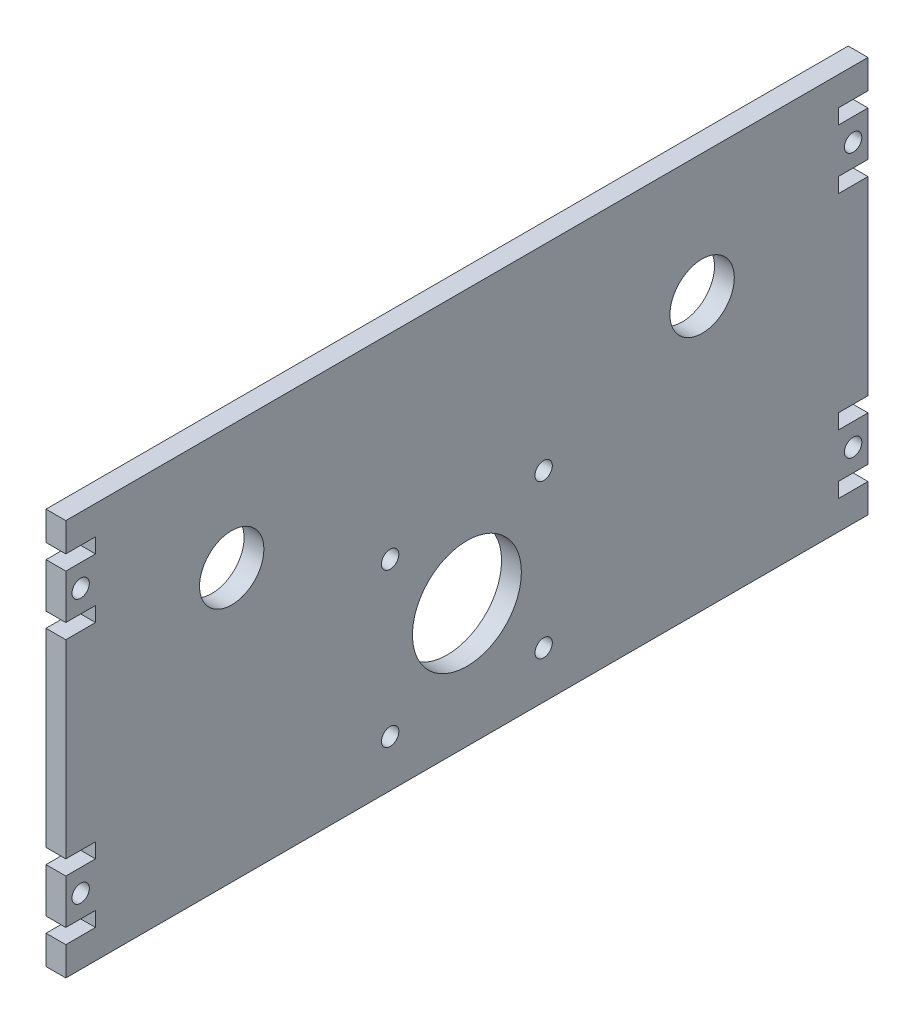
ISO-10303-21;
HEADER;
FILE_DESCRIPTION(('STEP AP214'),'2;1');
FILE_NAME('part.step','',(''),(''),'','','');
FILE_SCHEMA(('AUTOMOTIVE_DESIGN { 1 0 10303 214 1 1 1 1 }'));
ENDSEC;
DATA;
#1=APPLICATION_CONTEXT('core data for automotive mechanical design processes');
#2=APPLICATION_PROTOCOL_DEFINITION('international standard','automotive_design',2000,#1);
#3=PRODUCT_CONTEXT('',#1,'mechanical');
#4=PRODUCT('Part','Part','',(#3));
#5=PRODUCT_RELATED_PRODUCT_CATEGORY('part','',(#4));
#6=PRODUCT_DEFINITION_FORMATION('','',#4);
#7=PRODUCT_DEFINITION_CONTEXT('part definition',#1,'design');
#8=PRODUCT_DEFINITION('design','',#6,#7);
#9=PRODUCT_DEFINITION_SHAPE('','',#8);
#10=(LENGTH_UNIT() NAMED_UNIT(*) SI_UNIT(.MILLI.,.METRE.));
#11=(NAMED_UNIT(*) PLANE_ANGLE_UNIT() SI_UNIT($,.RADIAN.));
#12=(NAMED_UNIT(*) SI_UNIT($,.STERADIAN.) SOLID_ANGLE_UNIT());
#13=UNCERTAINTY_MEASURE_WITH_UNIT(LENGTH_MEASURE(1.E-05),#10,'distance_accuracy_value','');
#14=(GEOMETRIC_REPRESENTATION_CONTEXT(3) GLOBAL_UNCERTAINTY_ASSIGNED_CONTEXT((#13)) GLOBAL_UNIT_ASSIGNED_CONTEXT((#10,
#11,#12)) REPRESENTATION_CONTEXT('',''));
#15=CARTESIAN_POINT('',(0.,0.,0.));
#16=DIRECTION('',(0.,0.,1.));
#17=DIRECTION('',(1.,0.,0.));
#18=AXIS2_PLACEMENT_3D('',#15,#16,#17);
#19=CARTESIAN_POINT('',(2.,-40.,81.));
#20=DIRECTION('',(0.,0.,-1.));
#21=DIRECTION('',(-1.,0.,0.));
#22=AXIS2_PLACEMENT_3D('',#19,#20,#21);
#23=PLANE('',#22);
#24=DIRECTION('',(0.,-1.,0.));
#25=VECTOR('',#24,1.);
#26=CARTESIAN_POINT('',(-2.,-40.,81.));
#27=LINE('',#26,#25);
#28=CARTESIAN_POINT('',(-2.,-22.1666666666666,81.));
#29=VERTEX_POINT('',#28);
#30=CARTESIAN_POINT('',(-2.,-31.1666666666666,81.));
#31=VERTEX_POINT('',#30);
#32=EDGE_CURVE('E536',#29,#31,#27,.T.);
#33=ORIENTED_EDGE('',*,*,#32,.T.);
#34=DIRECTION('',(1.,0.,0.));
#35=VECTOR('',#34,1.);
#36=CARTESIAN_POINT('',(-2.,-31.1666666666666,81.));
#37=LINE('',#36,#35);
#38=CARTESIAN_POINT('',(2.,-31.1666666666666,81.));
#39=VERTEX_POINT('',#38);
#40=EDGE_CURVE('E451',#31,#39,#37,.T.);
#41=ORIENTED_EDGE('',*,*,#40,.T.);
#42=DIRECTION('',(0.,-1.,0.));
#43=VECTOR('',#42,1.);
#44=CARTESIAN_POINT('',(2.,-40.,81.));
#45=LINE('',#44,#43);
#46=CARTESIAN_POINT('',(2.,-22.1666666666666,81.));
#47=VERTEX_POINT('',#46);
#48=EDGE_CURVE('E565',#47,#39,#45,.T.);
#49=ORIENTED_EDGE('',*,*,#48,.F.);
#50=DIRECTION('',(1.,0.,0.));
#51=VECTOR('',#50,1.);
#52=CARTESIAN_POINT('',(-2.,-22.1666666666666,81.));
#53=LINE('',#52,#51);
#54=EDGE_CURVE('E442',#29,#47,#53,.T.);
#55=ORIENTED_EDGE('',*,*,#54,.F.);
#56=EDGE_LOOP('',(#33,#41,#49,#55));
#57=FACE_BOUND('',#56,.T.);
#58=ADVANCED_FACE('F34',(#57),#23,.F.);
#59=CARTESIAN_POINT('',(-2.,19.1666666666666,81.));
#60=VERTEX_POINT('',#59);
#61=CARTESIAN_POINT('',(-2.,-19.1666666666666,81.));
#62=VERTEX_POINT('',#61);
#63=EDGE_CURVE('E535',#60,#62,#27,.T.);
#64=ORIENTED_EDGE('',*,*,#63,.T.);
#65=DIRECTION('',(1.,0.,0.));
#66=VECTOR('',#65,1.);
#67=CARTESIAN_POINT('',(-2.,-19.1666666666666,81.));
#68=LINE('',#67,#66);
#69=CARTESIAN_POINT('',(2.,-19.1666666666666,81.));
#70=VERTEX_POINT('',#69);
#71=EDGE_CURVE('E430',#62,#70,#68,.T.);
#72=ORIENTED_EDGE('',*,*,#71,.T.);
#73=CARTESIAN_POINT('',(2.,19.1666666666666,81.));
#74=VERTEX_POINT('',#73);
#75=EDGE_CURVE('E563',#74,#70,#45,.T.);
#76=ORIENTED_EDGE('',*,*,#75,.F.);
#77=DIRECTION('',(1.,0.,0.));
#78=VECTOR('',#77,1.);
#79=CARTESIAN_POINT('',(-2.,19.1666666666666,81.));
#80=LINE('',#79,#78);
#81=EDGE_CURVE('E404',#60,#74,#80,.T.);
#82=ORIENTED_EDGE('',*,*,#81,.F.);
#83=EDGE_LOOP('',(#64,#72,#76,#82));
#84=FACE_BOUND('',#83,.T.);
#85=ADVANCED_FACE('F549',(#84),#23,.F.);
#86=CARTESIAN_POINT('',(-2.,31.1666666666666,81.));
#87=VERTEX_POINT('',#86);
#88=CARTESIAN_POINT('',(-2.,22.1666666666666,81.));
#89=VERTEX_POINT('',#88);
#90=EDGE_CURVE('E531',#87,#89,#27,.T.);
#91=ORIENTED_EDGE('',*,*,#90,.T.);
#92=DIRECTION('',(1.,0.,0.));
#93=VECTOR('',#92,1.);
#94=CARTESIAN_POINT('',(-2.,22.1666666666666,81.));
#95=LINE('',#94,#93);
#96=CARTESIAN_POINT('',(2.,22.1666666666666,81.));
#97=VERTEX_POINT('',#96);
#98=EDGE_CURVE('E393',#89,#97,#95,.T.);
#99=ORIENTED_EDGE('',*,*,#98,.T.);
#100=CARTESIAN_POINT('',(2.,31.1666666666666,81.));
#101=VERTEX_POINT('',#100);
#102=EDGE_CURVE('E524',#101,#97,#45,.T.);
#103=ORIENTED_EDGE('',*,*,#102,.F.);
#104=DIRECTION('',(1.,0.,0.));
#105=VECTOR('',#104,1.);
#106=CARTESIAN_POINT('',(-2.,31.1666666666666,81.));
#107=LINE('',#106,#105);
#108=EDGE_CURVE('E462',#87,#101,#107,.T.);
#109=ORIENTED_EDGE('',*,*,#108,.F.);
#110=EDGE_LOOP('',(#91,#99,#103,#109));
#111=FACE_BOUND('',#110,.T.);
#112=ADVANCED_FACE('F588',(#111),#23,.F.);
#113=CARTESIAN_POINT('',(-2.,40.,81.));
#114=VERTEX_POINT('',#113);
#115=CARTESIAN_POINT('',(-2.,34.1666666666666,81.));
#116=VERTEX_POINT('',#115);
#117=EDGE_CURVE('E529',#114,#116,#27,.T.);
#118=ORIENTED_EDGE('',*,*,#117,.T.);
#119=DIRECTION('',(1.,0.,0.));
#120=VECTOR('',#119,1.);
#121=CARTESIAN_POINT('',(-2.,34.1666666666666,81.));
#122=LINE('',#121,#120);
#123=CARTESIAN_POINT('',(2.,34.1666666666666,81.));
#124=VERTEX_POINT('',#123);
#125=EDGE_CURVE('E469',#116,#124,#122,.T.);
#126=ORIENTED_EDGE('',*,*,#125,.T.);
#127=CARTESIAN_POINT('',(2.,40.,81.));
#128=VERTEX_POINT('',#127);
#129=EDGE_CURVE('E520',#128,#124,#45,.T.);
#130=ORIENTED_EDGE('',*,*,#129,.F.);
#131=DIRECTION('',(-1.,0.,0.));
#132=VECTOR('',#131,1.);
#133=CARTESIAN_POINT('',(2.,40.,81.));
#134=LINE('',#133,#132);
#135=EDGE_CURVE('E308',#128,#114,#134,.T.);
#136=ORIENTED_EDGE('',*,*,#135,.T.);
#137=EDGE_LOOP('',(#118,#126,#130,#136));
#138=FACE_BOUND('',#137,.T.);
#139=ADVANCED_FACE('F577',(#138),#23,.F.);
#140=CARTESIAN_POINT('',(2.,-40.,-81.));
#141=DIRECTION('',(0.,0.,1.));
#142=DIRECTION('',(1.,0.,0.));
#143=AXIS2_PLACEMENT_3D('',#140,#141,#142);
#144=PLANE('',#143);
#145=DIRECTION('',(0.,1.,0.));
#146=VECTOR('',#145,1.);
#147=CARTESIAN_POINT('',(-2.,-40.,-81.));
#148=LINE('',#147,#146);
#149=CARTESIAN_POINT('',(-2.,-31.1666666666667,-81.));
#150=VERTEX_POINT('',#149);
#151=CARTESIAN_POINT('',(-2.,-22.1666666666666,-81.));
#152=VERTEX_POINT('',#151);
#153=EDGE_CURVE('E293',#150,#152,#148,.T.);
#154=ORIENTED_EDGE('',*,*,#153,.T.);
#155=DIRECTION('',(1.,0.,0.));
#156=VECTOR('',#155,1.);
#157=CARTESIAN_POINT('',(-2.,-22.1666666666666,-81.));
#158=LINE('',#157,#156);
#159=CARTESIAN_POINT('',(2.,-22.1666666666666,-81.));
#160=VERTEX_POINT('',#159);
#161=EDGE_CURVE('E363',#152,#160,#158,.T.);
#162=ORIENTED_EDGE('',*,*,#161,.T.);
#163=DIRECTION('',(0.,1.,0.));
#164=VECTOR('',#163,1.);
#165=CARTESIAN_POINT('',(2.,-40.,-81.));
#166=LINE('',#165,#164);
#167=CARTESIAN_POINT('',(2.,-31.1666666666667,-81.));
#168=VERTEX_POINT('',#167);
#169=EDGE_CURVE('E528',#168,#160,#166,.T.);
#170=ORIENTED_EDGE('',*,*,#169,.F.);
#171=DIRECTION('',(1.,0.,0.));
#172=VECTOR('',#171,1.);
#173=CARTESIAN_POINT('',(-2.,-31.1666666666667,-81.));
#174=LINE('',#173,#172);
#175=EDGE_CURVE('E355',#150,#168,#174,.T.);
#176=ORIENTED_EDGE('',*,*,#175,.F.);
#177=EDGE_LOOP('',(#154,#162,#170,#176));
#178=FACE_BOUND('',#177,.T.);
#179=ADVANCED_FACE('F587',(#178),#144,.F.);
#180=CARTESIAN_POINT('',(-2.,-40.,-81.));
#181=VERTEX_POINT('',#180);
#182=CARTESIAN_POINT('',(-2.,-34.1666666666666,-81.));
#183=VERTEX_POINT('',#182);
#184=EDGE_CURVE('E297',#181,#183,#148,.T.);
#185=ORIENTED_EDGE('',*,*,#184,.T.);
#186=DIRECTION('',(1.,0.,0.));
#187=VECTOR('',#186,1.);
#188=CARTESIAN_POINT('',(-2.,-34.1666666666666,-81.));
#189=LINE('',#188,#187);
#190=CARTESIAN_POINT('',(2.,-34.1666666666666,-81.));
#191=VERTEX_POINT('',#190);
#192=EDGE_CURVE('E344',#183,#191,#189,.T.);
#193=ORIENTED_EDGE('',*,*,#192,.T.);
#194=CARTESIAN_POINT('',(2.,-40.,-81.));
#195=VERTEX_POINT('',#194);
#196=EDGE_CURVE('E322',#195,#191,#166,.T.);
#197=ORIENTED_EDGE('',*,*,#196,.F.);
#198=DIRECTION('',(-1.,0.,0.));
#199=VECTOR('',#198,1.);
#200=CARTESIAN_POINT('',(2.,-40.,-81.));
#201=LINE('',#200,#199);
#202=EDGE_CURVE('E42',#195,#181,#201,.T.);
#203=ORIENTED_EDGE('',*,*,#202,.T.);
#204=EDGE_LOOP('',(#185,#193,#197,#203));
#205=FACE_BOUND('',#204,.T.);
#206=ADVANCED_FACE('F319',(#205),#144,.F.);
#207=CARTESIAN_POINT('',(2.,-19.1666666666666,-81.));
#208=VERTEX_POINT('',#207);
#209=CARTESIAN_POINT('',(2.,19.1666666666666,-81.));
#210=VERTEX_POINT('',#209);
#211=EDGE_CURVE('E994',#208,#210,#166,.T.);
#212=ORIENTED_EDGE('',*,*,#211,.F.);
#213=DIRECTION('',(1.,0.,0.));
#214=VECTOR('',#213,1.);
#215=CARTESIAN_POINT('',(-2.,-19.1666666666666,-81.));
#216=LINE('',#215,#214);
#217=CARTESIAN_POINT('',(-2.,-19.1666666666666,-81.));
#218=VERTEX_POINT('',#217);
#219=EDGE_CURVE('E292',#218,#208,#216,.T.);
#220=ORIENTED_EDGE('',*,*,#219,.F.);
#221=CARTESIAN_POINT('',(-2.,19.1666666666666,-81.));
#222=VERTEX_POINT('',#221);
#223=EDGE_CURVE('E285',#218,#222,#148,.T.);
#224=ORIENTED_EDGE('',*,*,#223,.T.);
#225=DIRECTION('',(1.,0.,0.));
#226=VECTOR('',#225,1.);
#227=CARTESIAN_POINT('',(-2.,19.1666666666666,-81.));
#228=LINE('',#227,#226);
#229=EDGE_CURVE('E267',#222,#210,#228,.T.);
#230=ORIENTED_EDGE('',*,*,#229,.T.);
#231=EDGE_LOOP('',(#212,#220,#224,#230));
#232=FACE_BOUND('',#231,.T.);
#233=ADVANCED_FACE('F291',(#232),#144,.F.);
#234=CARTESIAN_POINT('',(2.,22.1666666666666,-81.));
#235=VERTEX_POINT('',#234);
#236=CARTESIAN_POINT('',(2.,31.1666666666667,-81.));
#237=VERTEX_POINT('',#236);
#238=EDGE_CURVE('E995',#235,#237,#166,.T.);
#239=ORIENTED_EDGE('',*,*,#238,.F.);
#240=DIRECTION('',(1.,0.,0.));
#241=VECTOR('',#240,1.);
#242=CARTESIAN_POINT('',(-2.,22.1666666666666,-81.));
#243=LINE('',#242,#241);
#244=CARTESIAN_POINT('',(-2.,22.1666666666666,-81.));
#245=VERTEX_POINT('',#244);
#246=EDGE_CURVE('E278',#245,#235,#243,.T.);
#247=ORIENTED_EDGE('',*,*,#246,.F.);
#248=CARTESIAN_POINT('',(-2.,31.1666666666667,-81.));
#249=VERTEX_POINT('',#248);
#250=EDGE_CURVE('E294',#245,#249,#148,.T.);
#251=ORIENTED_EDGE('',*,*,#250,.T.);
#252=DIRECTION('',(1.,0.,0.));
#253=VECTOR('',#252,1.);
#254=CARTESIAN_POINT('',(-2.,31.1666666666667,-81.));
#255=LINE('',#254,#253);
#256=EDGE_CURVE('E1008',#249,#237,#255,.T.);
#257=ORIENTED_EDGE('',*,*,#256,.T.);
#258=EDGE_LOOP('',(#239,#247,#251,#257));
#259=FACE_BOUND('',#258,.T.);
#260=ADVANCED_FACE('F576',(#259),#144,.F.);
#261=CARTESIAN_POINT('',(2.,-34.1666666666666,81.));
#262=VERTEX_POINT('',#261);
#263=CARTESIAN_POINT('',(2.,-40.,81.));
#264=VERTEX_POINT('',#263);
#265=EDGE_CURVE('E307',#262,#264,#45,.T.);
#266=ORIENTED_EDGE('',*,*,#265,.F.);
#267=DIRECTION('',(1.,0.,0.));
#268=VECTOR('',#267,1.);
#269=CARTESIAN_POINT('',(-2.,-34.1666666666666,81.));
#270=LINE('',#269,#268);
#271=CARTESIAN_POINT('',(-2.,-34.1666666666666,81.));
#272=VERTEX_POINT('',#271);
#273=EDGE_CURVE('E340',#272,#262,#270,.T.);
#274=ORIENTED_EDGE('',*,*,#273,.F.);
#275=CARTESIAN_POINT('',(-2.,-40.,81.));
#276=VERTEX_POINT('',#275);
#277=EDGE_CURVE('E481',#272,#276,#27,.T.);
#278=ORIENTED_EDGE('',*,*,#277,.T.);
#279=DIRECTION('',(-1.,0.,0.));
#280=VECTOR('',#279,1.);
#281=CARTESIAN_POINT('',(2.,-40.,81.));
#282=LINE('',#281,#280);
#283=EDGE_CURVE('E11',#264,#276,#282,.T.);
#284=ORIENTED_EDGE('',*,*,#283,.F.);
#285=EDGE_LOOP('',(#266,#274,#278,#284));
#286=FACE_BOUND('',#285,.T.);
#287=ADVANCED_FACE('F36',(#286),#23,.F.);
#288=CARTESIAN_POINT('',(2.,-40.,-81.));
#289=DIRECTION('',(0.,1.,0.));
#290=DIRECTION('',(0.,0.,1.));
#291=AXIS2_PLACEMENT_3D('',#288,#289,#290);
#292=PLANE('',#291);
#293=DIRECTION('',(0.,0.,-1.));
#294=VECTOR('',#293,1.);
#295=CARTESIAN_POINT('',(-2.,-40.,-81.));
#296=LINE('',#295,#294);
#297=EDGE_CURVE('E304',#276,#181,#296,.T.);
#298=ORIENTED_EDGE('',*,*,#297,.T.);
#299=ORIENTED_EDGE('',*,*,#202,.F.);
#300=DIRECTION('',(0.,0.,-1.));
#301=VECTOR('',#300,1.);
#302=CARTESIAN_POINT('',(2.,-40.,-81.));
#303=LINE('',#302,#301);
#304=EDGE_CURVE('E523',#264,#195,#303,.T.);
#305=ORIENTED_EDGE('',*,*,#304,.F.);
#306=ORIENTED_EDGE('',*,*,#283,.T.);
#307=EDGE_LOOP('',(#298,#299,#305,#306));
#308=FACE_BOUND('',#307,.T.);
#309=ADVANCED_FACE('F574',(#308),#292,.F.);
#310=CARTESIAN_POINT('',(2.,34.1666666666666,-81.));
#311=VERTEX_POINT('',#310);
#312=CARTESIAN_POINT('',(2.,40.,-81.));
#313=VERTEX_POINT('',#312);
#314=EDGE_CURVE('E526',#311,#313,#166,.T.);
#315=ORIENTED_EDGE('',*,*,#314,.F.);
#316=DIRECTION('',(1.,0.,0.));
#317=VECTOR('',#316,1.);
#318=CARTESIAN_POINT('',(-2.,34.1666666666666,-81.));
#319=LINE('',#318,#317);
#320=CARTESIAN_POINT('',(-2.,34.1666666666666,-81.));
#321=VERTEX_POINT('',#320);
#322=EDGE_CURVE('E631',#321,#311,#319,.T.);
#323=ORIENTED_EDGE('',*,*,#322,.F.);
#324=CARTESIAN_POINT('',(-2.,40.,-81.));
#325=VERTEX_POINT('',#324);
#326=EDGE_CURVE('E299',#321,#325,#148,.T.);
#327=ORIENTED_EDGE('',*,*,#326,.T.);
#328=DIRECTION('',(-1.,0.,0.));
#329=VECTOR('',#328,1.);
#330=CARTESIAN_POINT('',(2.,40.,-81.));
#331=LINE('',#330,#329);
#332=EDGE_CURVE('E311',#313,#325,#331,.T.);
#333=ORIENTED_EDGE('',*,*,#332,.F.);
#334=EDGE_LOOP('',(#315,#323,#327,#333));
#335=FACE_BOUND('',#334,.T.);
#336=ADVANCED_FACE('F582',(#335),#144,.F.);
#337=CARTESIAN_POINT('',(2.,40.,-81.));
#338=DIRECTION('',(0.,-1.,0.));
#339=DIRECTION('',(0.,0.,-1.));
#340=AXIS2_PLACEMENT_3D('',#337,#338,#339);
#341=PLANE('',#340);
#342=DIRECTION('',(0.,0.,1.));
#343=VECTOR('',#342,1.);
#344=CARTESIAN_POINT('',(-2.,40.,-81.));
#345=LINE('',#344,#343);
#346=EDGE_CURVE('E303',#325,#114,#345,.T.);
#347=ORIENTED_EDGE('',*,*,#346,.T.);
#348=ORIENTED_EDGE('',*,*,#135,.F.);
#349=DIRECTION('',(0.,0.,1.));
#350=VECTOR('',#349,1.);
#351=CARTESIAN_POINT('',(2.,40.,-81.));
#352=LINE('',#351,#350);
#353=EDGE_CURVE('E312',#313,#128,#352,.T.);
#354=ORIENTED_EDGE('',*,*,#353,.F.);
#355=ORIENTED_EDGE('',*,*,#332,.T.);
#356=EDGE_LOOP('',(#347,#348,#354,#355));
#357=FACE_BOUND('',#356,.T.);
#358=ADVANCED_FACE('F624',(#357),#341,.F.);
#359=CARTESIAN_POINT('',(2.,0.,0.));
#360=DIRECTION('',(1.,0.,0.));
#361=DIRECTION('',(0.,0.,-1.));
#362=AXIS2_PLACEMENT_3D('',#359,#360,#361);
#363=PLANE('',#362);
#364=DIRECTION('',(0.,0.,-1.));
#365=VECTOR('',#364,1.);
#366=CARTESIAN_POINT('',(2.,-22.1666666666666,-81.));
#367=LINE('',#366,#365);
#368=CARTESIAN_POINT('',(2.,-22.1666666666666,-75.));
#369=VERTEX_POINT('',#368);
#370=EDGE_CURVE('E366',#369,#160,#367,.T.);
#371=ORIENTED_EDGE('',*,*,#370,.F.);
#372=DIRECTION('',(0.,-1.,0.));
#373=VECTOR('',#372,1.);
#374=CARTESIAN_POINT('',(2.,-19.1666666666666,-75.));
#375=LINE('',#374,#373);
#376=CARTESIAN_POINT('',(2.,-19.1666666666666,-75.));
#377=VERTEX_POINT('',#376);
#378=EDGE_CURVE('E374',#377,#369,#375,.T.);
#379=ORIENTED_EDGE('',*,*,#378,.F.);
#380=DIRECTION('',(0.,0.,1.));
#381=VECTOR('',#380,1.);
#382=CARTESIAN_POINT('',(2.,-19.1666666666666,-81.));
#383=LINE('',#382,#381);
#384=EDGE_CURVE('E371',#208,#377,#383,.T.);
#385=ORIENTED_EDGE('',*,*,#384,.F.);
#386=ORIENTED_EDGE('',*,*,#211,.T.);
#387=DIRECTION('',(0.,0.,-1.));
#388=VECTOR('',#387,1.);
#389=CARTESIAN_POINT('',(2.,19.1666666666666,-81.));
#390=LINE('',#389,#388);
#391=CARTESIAN_POINT('',(2.,19.1666666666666,-75.));
#392=VERTEX_POINT('',#391);
#393=EDGE_CURVE('E273',#392,#210,#390,.T.);
#394=ORIENTED_EDGE('',*,*,#393,.F.);
#395=DIRECTION('',(0.,-1.,0.));
#396=VECTOR('',#395,1.);
#397=CARTESIAN_POINT('',(2.,19.1666666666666,-75.));
#398=LINE('',#397,#396);
#399=CARTESIAN_POINT('',(2.,22.1666666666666,-75.));
#400=VERTEX_POINT('',#399);
#401=EDGE_CURVE('E288',#400,#392,#398,.T.);
#402=ORIENTED_EDGE('',*,*,#401,.F.);
#403=DIRECTION('',(0.,0.,1.));
#404=VECTOR('',#403,1.);
#405=CARTESIAN_POINT('',(2.,22.1666666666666,-81.));
#406=LINE('',#405,#404);
#407=EDGE_CURVE('E1004',#235,#400,#406,.T.);
#408=ORIENTED_EDGE('',*,*,#407,.F.);
#409=ORIENTED_EDGE('',*,*,#238,.T.);
#410=DIRECTION('',(0.,0.,-1.));
#411=VECTOR('',#410,1.);
#412=CARTESIAN_POINT('',(2.,31.1666666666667,-81.));
#413=LINE('',#412,#411);
#414=CARTESIAN_POINT('',(2.,31.1666666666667,-75.));
#415=VERTEX_POINT('',#414);
#416=EDGE_CURVE('E1001',#415,#237,#413,.T.);
#417=ORIENTED_EDGE('',*,*,#416,.F.);
#418=DIRECTION('',(0.,-1.,0.));
#419=VECTOR('',#418,1.);
#420=CARTESIAN_POINT('',(2.,34.1666666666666,-75.));
#421=LINE('',#420,#419);
#422=CARTESIAN_POINT('',(2.,34.1666666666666,-75.));
#423=VERTEX_POINT('',#422);
#424=EDGE_CURVE('E1017',#423,#415,#421,.T.);
#425=ORIENTED_EDGE('',*,*,#424,.F.);
#426=DIRECTION('',(0.,0.,1.));
#427=VECTOR('',#426,1.);
#428=CARTESIAN_POINT('',(2.,34.1666666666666,-81.));
#429=LINE('',#428,#427);
#430=EDGE_CURVE('E1020',#311,#423,#429,.T.);
#431=ORIENTED_EDGE('',*,*,#430,.F.);
#432=ORIENTED_EDGE('',*,*,#314,.T.);
#433=ORIENTED_EDGE('',*,*,#353,.T.);
#434=ORIENTED_EDGE('',*,*,#129,.T.);
#435=DIRECTION('',(0.,0.,1.));
#436=VECTOR('',#435,1.);
#437=CARTESIAN_POINT('',(2.,34.1666666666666,81.));
#438=LINE('',#437,#436);
#439=CARTESIAN_POINT('',(2.,34.1666666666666,75.));
#440=VERTEX_POINT('',#439);
#441=EDGE_CURVE('E456',#440,#124,#438,.T.);
#442=ORIENTED_EDGE('',*,*,#441,.F.);
#443=DIRECTION('',(0.,1.,0.));
#444=VECTOR('',#443,1.);
#445=CARTESIAN_POINT('',(2.,34.1666666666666,75.));
#446=LINE('',#445,#444);
#447=CARTESIAN_POINT('',(2.,31.1666666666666,75.));
#448=VERTEX_POINT('',#447);
#449=EDGE_CURVE('E465',#448,#440,#446,.T.);
#450=ORIENTED_EDGE('',*,*,#449,.F.);
#451=DIRECTION('',(0.,0.,-1.));
#452=VECTOR('',#451,1.);
#453=CARTESIAN_POINT('',(2.,31.1666666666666,81.));
#454=LINE('',#453,#452);
#455=EDGE_CURVE('E389',#101,#448,#454,.T.);
#456=ORIENTED_EDGE('',*,*,#455,.F.);
#457=ORIENTED_EDGE('',*,*,#102,.T.);
#458=DIRECTION('',(0.,0.,1.));
#459=VECTOR('',#458,1.);
#460=CARTESIAN_POINT('',(2.,22.1666666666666,81.));
#461=LINE('',#460,#459);
#462=CARTESIAN_POINT('',(2.,22.1666666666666,75.));
#463=VERTEX_POINT('',#462);
#464=EDGE_CURVE('E398',#463,#97,#461,.T.);
#465=ORIENTED_EDGE('',*,*,#464,.F.);
#466=DIRECTION('',(0.,1.,0.));
#467=VECTOR('',#466,1.);
#468=CARTESIAN_POINT('',(2.,19.1666666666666,75.));
#469=LINE('',#468,#467);
#470=CARTESIAN_POINT('',(2.,19.1666666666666,75.));
#471=VERTEX_POINT('',#470);
#472=EDGE_CURVE('E408',#471,#463,#469,.T.);
#473=ORIENTED_EDGE('',*,*,#472,.F.);
#474=DIRECTION('',(0.,0.,-1.));
#475=VECTOR('',#474,1.);
#476=CARTESIAN_POINT('',(2.,19.1666666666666,81.));
#477=LINE('',#476,#475);
#478=EDGE_CURVE('E405',#74,#471,#477,.T.);
#479=ORIENTED_EDGE('',*,*,#478,.F.);
#480=ORIENTED_EDGE('',*,*,#75,.T.);
#481=DIRECTION('',(0.,0.,1.));
#482=VECTOR('',#481,1.);
#483=CARTESIAN_POINT('',(2.,-19.1666666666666,81.));
#484=LINE('',#483,#482);
#485=CARTESIAN_POINT('',(2.,-19.1666666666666,75.));
#486=VERTEX_POINT('',#485);
#487=EDGE_CURVE('E431',#486,#70,#484,.T.);
#488=ORIENTED_EDGE('',*,*,#487,.F.);
#489=DIRECTION('',(0.,1.,0.));
#490=VECTOR('',#489,1.);
#491=CARTESIAN_POINT('',(2.,-19.1666666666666,75.));
#492=LINE('',#491,#490);
#493=CARTESIAN_POINT('',(2.,-22.1666666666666,75.));
#494=VERTEX_POINT('',#493);
#495=EDGE_CURVE('E424',#494,#486,#492,.T.);
#496=ORIENTED_EDGE('',*,*,#495,.F.);
#497=DIRECTION('',(0.,0.,-1.));
#498=VECTOR('',#497,1.);
#499=CARTESIAN_POINT('',(2.,-22.1666666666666,81.));
#500=LINE('',#499,#498);
#501=EDGE_CURVE('E433',#47,#494,#500,.T.);
#502=ORIENTED_EDGE('',*,*,#501,.F.);
#503=ORIENTED_EDGE('',*,*,#48,.T.);
#504=DIRECTION('',(0.,0.,1.));
#505=VECTOR('',#504,1.);
#506=CARTESIAN_POINT('',(2.,-31.1666666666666,81.));
#507=LINE('',#506,#505);
#508=CARTESIAN_POINT('',(2.,-31.1666666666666,75.));
#509=VERTEX_POINT('',#508);
#510=EDGE_CURVE('E648',#509,#39,#507,.T.);
#511=ORIENTED_EDGE('',*,*,#510,.F.);
#512=DIRECTION('',(0.,1.,0.));
#513=VECTOR('',#512,1.);
#514=CARTESIAN_POINT('',(2.,-34.1666666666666,75.));
#515=LINE('',#514,#513);
#516=CARTESIAN_POINT('',(2.,-34.1666666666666,75.));
#517=VERTEX_POINT('',#516);
#518=EDGE_CURVE('E655',#517,#509,#515,.T.);
#519=ORIENTED_EDGE('',*,*,#518,.F.);
#520=DIRECTION('',(0.,0.,-1.));
#521=VECTOR('',#520,1.);
#522=CARTESIAN_POINT('',(2.,-34.1666666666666,81.));
#523=LINE('',#522,#521);
#524=EDGE_CURVE('E352',#262,#517,#523,.T.);
#525=ORIENTED_EDGE('',*,*,#524,.F.);
#526=ORIENTED_EDGE('',*,*,#265,.T.);
#527=ORIENTED_EDGE('',*,*,#304,.T.);
#528=ORIENTED_EDGE('',*,*,#196,.T.);
#529=DIRECTION('',(0.,0.,-1.));
#530=VECTOR('',#529,1.);
#531=CARTESIAN_POINT('',(2.,-34.1666666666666,-81.));
#532=LINE('',#531,#530);
#533=CARTESIAN_POINT('',(2.,-34.1666666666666,-75.));
#534=VERTEX_POINT('',#533);
#535=EDGE_CURVE('E345',#534,#191,#532,.T.);
#536=ORIENTED_EDGE('',*,*,#535,.F.);
#537=DIRECTION('',(0.,-1.,0.));
#538=VECTOR('',#537,1.);
#539=CARTESIAN_POINT('',(2.,-34.1666666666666,-75.));
#540=LINE('',#539,#538);
#541=CARTESIAN_POINT('',(2.,-31.1666666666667,-75.));
#542=VERTEX_POINT('',#541);
#543=EDGE_CURVE('E333',#542,#534,#540,.T.);
#544=ORIENTED_EDGE('',*,*,#543,.F.);
#545=DIRECTION('',(0.,0.,1.));
#546=VECTOR('',#545,1.);
#547=CARTESIAN_POINT('',(2.,-31.1666666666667,-81.));
#548=LINE('',#547,#546);
#549=EDGE_CURVE('E337',#168,#542,#548,.T.);
#550=ORIENTED_EDGE('',*,*,#549,.F.);
#551=ORIENTED_EDGE('',*,*,#169,.T.);
#552=EDGE_LOOP('',(#371,#379,#385,#386,#394,#402,#408,#409,#417,#425,#431,#432,#433,#434,#442,
#450,#456,#457,#465,#473,#479,#480,#488,#496,#502,#503,#511,#519,#525,#526,#527,#528,#536,#544,
#550,#551));
#553=FACE_BOUND('',#552,.T.);
#554=CARTESIAN_POINT('',(2.,-26.6666666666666,-78.));
#555=DIRECTION('',(1.,0.,0.));
#556=DIRECTION('',(0.,0.,-1.));
#557=AXIS2_PLACEMENT_3D('',#554,#555,#556);
#558=CIRCLE('',#557,1.75);
#559=CARTESIAN_POINT('',(2.,-26.6666666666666,-79.75));
#560=VERTEX_POINT('',#559);
#561=EDGE_CURVE('E360',#560,#560,#558,.T.);
#562=ORIENTED_EDGE('',*,*,#561,.F.);
#563=EDGE_LOOP('',(#562));
#564=FACE_BOUND('',#563,.T.);
#565=CARTESIAN_POINT('',(2.,-26.6666666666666,78.));
#566=DIRECTION('',(1.,0.,0.));
#567=DIRECTION('',(0.,0.,1.));
#568=AXIS2_PLACEMENT_3D('',#565,#566,#567);
#569=CIRCLE('',#568,1.75);
#570=CARTESIAN_POINT('',(2.,-26.6666666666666,79.75));
#571=VERTEX_POINT('',#570);
#572=EDGE_CURVE('E448',#571,#571,#569,.T.);
#573=ORIENTED_EDGE('',*,*,#572,.F.);
#574=EDGE_LOOP('',(#573));
#575=FACE_BOUND('',#574,.T.);
#576=CARTESIAN_POINT('',(2.,26.6666666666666,78.));
#577=DIRECTION('',(1.,0.,0.));
#578=DIRECTION('',(0.,0.,-1.));
#579=AXIS2_PLACEMENT_3D('',#576,#577,#578);
#580=CIRCLE('',#579,1.75);
#581=CARTESIAN_POINT('',(2.,26.6666666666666,76.25));
#582=VERTEX_POINT('',#581);
#583=EDGE_CURVE('E390',#582,#582,#580,.T.);
#584=ORIENTED_EDGE('',*,*,#583,.F.);
#585=EDGE_LOOP('',(#584));
#586=FACE_BOUND('',#585,.T.);
#587=CARTESIAN_POINT('',(2.,26.6666666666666,-78.));
#588=DIRECTION('',(1.,0.,0.));
#589=DIRECTION('',(0.,0.,1.));
#590=AXIS2_PLACEMENT_3D('',#587,#588,#589);
#591=CIRCLE('',#590,1.75);
#592=CARTESIAN_POINT('',(2.,26.6666666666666,-76.25));
#593=VERTEX_POINT('',#592);
#594=EDGE_CURVE('E1010',#593,#593,#591,.T.);
#595=ORIENTED_EDGE('',*,*,#594,.F.);
#596=EDGE_LOOP('',(#595));
#597=FACE_BOUND('',#596,.T.);
#598=CARTESIAN_POINT('',(2.,15.,47.5));
#599=DIRECTION('',(1.,0.,0.));
#600=DIRECTION('',(0.,0.,-1.));
#601=AXIS2_PLACEMENT_3D('',#598,#599,#600);
#602=CIRCLE('',#601,6.5);
#603=CARTESIAN_POINT('',(2.,15.,41.));
#604=VERTEX_POINT('',#603);
#605=EDGE_CURVE('E482',#604,#604,#602,.T.);
#606=ORIENTED_EDGE('',*,*,#605,.F.);
#607=EDGE_LOOP('',(#606));
#608=FACE_BOUND('',#607,.T.);
#609=CARTESIAN_POINT('',(2.,0.499999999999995,-15.5));
#610=DIRECTION('',(1.,0.,0.));
#611=DIRECTION('',(0.,0.,-1.));
#612=AXIS2_PLACEMENT_3D('',#609,#610,#611);
#613=CIRCLE('',#612,1.75);
#614=CARTESIAN_POINT('',(2.,0.499999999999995,-17.25));
#615=VERTEX_POINT('',#614);
#616=EDGE_CURVE('E472',#615,#615,#613,.T.);
#617=ORIENTED_EDGE('',*,*,#616,.F.);
#618=EDGE_LOOP('',(#617));
#619=FACE_BOUND('',#618,.T.);
#620=CARTESIAN_POINT('',(2.,-30.5,-15.5));
#621=DIRECTION('',(1.,0.,0.));
#622=DIRECTION('',(0.,0.,-1.));
#623=AXIS2_PLACEMENT_3D('',#620,#621,#622);
#624=CIRCLE('',#623,1.75);
#625=CARTESIAN_POINT('',(2.,-30.5,-17.25));
#626=VERTEX_POINT('',#625);
#627=EDGE_CURVE('E490',#626,#626,#624,.T.);
#628=ORIENTED_EDGE('',*,*,#627,.F.);
#629=EDGE_LOOP('',(#628));
#630=FACE_BOUND('',#629,.T.);
#631=CARTESIAN_POINT('',(2.,-30.5,15.5));
#632=DIRECTION('',(1.,0.,0.));
#633=DIRECTION('',(0.,0.,-1.));
#634=AXIS2_PLACEMENT_3D('',#631,#632,#633);
#635=CIRCLE('',#634,1.75);
#636=CARTESIAN_POINT('',(2.,-30.5,13.75));
#637=VERTEX_POINT('',#636);
#638=EDGE_CURVE('E489',#637,#637,#635,.T.);
#639=ORIENTED_EDGE('',*,*,#638,.F.);
#640=EDGE_LOOP('',(#639));
#641=FACE_BOUND('',#640,.T.);
#642=CARTESIAN_POINT('',(2.,0.499999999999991,15.5));
#643=DIRECTION('',(1.,0.,0.));
#644=DIRECTION('',(0.,0.,-1.));
#645=AXIS2_PLACEMENT_3D('',#642,#643,#644);
#646=CIRCLE('',#645,1.75);
#647=CARTESIAN_POINT('',(2.,0.499999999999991,13.75));
#648=VERTEX_POINT('',#647);
#649=EDGE_CURVE('E512',#648,#648,#646,.T.);
#650=ORIENTED_EDGE('',*,*,#649,.F.);
#651=EDGE_LOOP('',(#650));
#652=FACE_BOUND('',#651,.T.);
#653=CARTESIAN_POINT('',(2.,-15.,0.));
#654=DIRECTION('',(1.,0.,0.));
#655=DIRECTION('',(0.,0.,-1.));
#656=AXIS2_PLACEMENT_3D('',#653,#654,#655);
#657=CIRCLE('',#656,11.);
#658=CARTESIAN_POINT('',(2.,-15.,-11.));
#659=VERTEX_POINT('',#658);
#660=EDGE_CURVE('E506',#659,#659,#657,.T.);
#661=ORIENTED_EDGE('',*,*,#660,.F.);
#662=EDGE_LOOP('',(#661));
#663=FACE_BOUND('',#662,.T.);
#664=CARTESIAN_POINT('',(2.,15.,-47.5));
#665=DIRECTION('',(1.,0.,0.));
#666=DIRECTION('',(0.,0.,-1.));
#667=AXIS2_PLACEMENT_3D('',#664,#665,#666);
#668=CIRCLE('',#667,6.49999999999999);
#669=CARTESIAN_POINT('',(2.,15.,-54.));
#670=VERTEX_POINT('',#669);
#671=EDGE_CURVE('E500',#670,#670,#668,.T.);
#672=ORIENTED_EDGE('',*,*,#671,.F.);
#673=EDGE_LOOP('',(#672));
#674=FACE_BOUND('',#673,.T.);
#675=ADVANCED_FACE('F559',(#553,#564,#575,#586,#597,#608,#619,#630,#641,#652,#663,#674),#363,.T.);
#676=CARTESIAN_POINT('',(-2.,0.,0.));
#677=DIRECTION('',(1.,0.,0.));
#678=DIRECTION('',(0.,0.,-1.));
#679=AXIS2_PLACEMENT_3D('',#676,#677,#678);
#680=PLANE('',#679);
#681=CARTESIAN_POINT('',(-2.,-26.6666666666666,-78.));
#682=DIRECTION('',(1.,0.,0.));
#683=DIRECTION('',(0.,0.,-1.));
#684=AXIS2_PLACEMENT_3D('',#681,#682,#683);
#685=CIRCLE('',#684,1.75);
#686=CARTESIAN_POINT('',(-2.,-26.6666666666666,-79.75));
#687=VERTEX_POINT('',#686);
#688=EDGE_CURVE('E347',#687,#687,#685,.T.);
#689=ORIENTED_EDGE('',*,*,#688,.T.);
#690=EDGE_LOOP('',(#689));
#691=FACE_BOUND('',#690,.T.);
#692=CARTESIAN_POINT('',(-2.,-26.6666666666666,78.));
#693=DIRECTION('',(1.,0.,0.));
#694=DIRECTION('',(0.,0.,1.));
#695=AXIS2_PLACEMENT_3D('',#692,#693,#694);
#696=CIRCLE('',#695,1.75);
#697=CARTESIAN_POINT('',(-2.,-26.6666666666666,79.75));
#698=VERTEX_POINT('',#697);
#699=EDGE_CURVE('E434',#698,#698,#696,.T.);
#700=ORIENTED_EDGE('',*,*,#699,.T.);
#701=EDGE_LOOP('',(#700));
#702=FACE_BOUND('',#701,.T.);
#703=CARTESIAN_POINT('',(-2.,26.6666666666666,78.));
#704=DIRECTION('',(1.,0.,0.));
#705=DIRECTION('',(0.,0.,-1.));
#706=AXIS2_PLACEMENT_3D('',#703,#704,#705);
#707=CIRCLE('',#706,1.75);
#708=CARTESIAN_POINT('',(-2.,26.6666666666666,76.25));
#709=VERTEX_POINT('',#708);
#710=EDGE_CURVE('E386',#709,#709,#707,.T.);
#711=ORIENTED_EDGE('',*,*,#710,.T.);
#712=EDGE_LOOP('',(#711));
#713=FACE_BOUND('',#712,.T.);
#714=CARTESIAN_POINT('',(-2.,26.6666666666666,-78.));
#715=DIRECTION('',(1.,0.,0.));
#716=DIRECTION('',(0.,0.,1.));
#717=AXIS2_PLACEMENT_3D('',#714,#715,#716);
#718=CIRCLE('',#717,1.75);
#719=CARTESIAN_POINT('',(-2.,26.6666666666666,-76.25));
#720=VERTEX_POINT('',#719);
#721=EDGE_CURVE('E1013',#720,#720,#718,.T.);
#722=ORIENTED_EDGE('',*,*,#721,.T.);
#723=EDGE_LOOP('',(#722));
#724=FACE_BOUND('',#723,.T.);
#725=CARTESIAN_POINT('',(-2.,15.,47.5));
#726=DIRECTION('',(1.,0.,0.));
#727=DIRECTION('',(0.,0.,-1.));
#728=AXIS2_PLACEMENT_3D('',#725,#726,#727);
#729=CIRCLE('',#728,6.5);
#730=CARTESIAN_POINT('',(-2.,15.,41.));
#731=VERTEX_POINT('',#730);
#732=EDGE_CURVE('E478',#731,#731,#729,.T.);
#733=ORIENTED_EDGE('',*,*,#732,.T.);
#734=EDGE_LOOP('',(#733));
#735=FACE_BOUND('',#734,.T.);
#736=CARTESIAN_POINT('',(-2.,0.499999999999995,-15.5));
#737=DIRECTION('',(1.,0.,0.));
#738=DIRECTION('',(0.,0.,-1.));
#739=AXIS2_PLACEMENT_3D('',#736,#737,#738);
#740=CIRCLE('',#739,1.75);
#741=CARTESIAN_POINT('',(-2.,0.499999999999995,-17.25));
#742=VERTEX_POINT('',#741);
#743=EDGE_CURVE('E493',#742,#742,#740,.T.);
#744=ORIENTED_EDGE('',*,*,#743,.T.);
#745=EDGE_LOOP('',(#744));
#746=FACE_BOUND('',#745,.T.);
#747=CARTESIAN_POINT('',(-2.,-30.5,-15.5));
#748=DIRECTION('',(1.,0.,0.));
#749=DIRECTION('',(0.,0.,-1.));
#750=AXIS2_PLACEMENT_3D('',#747,#748,#749);
#751=CIRCLE('',#750,1.75);
#752=CARTESIAN_POINT('',(-2.,-30.5,-17.25));
#753=VERTEX_POINT('',#752);
#754=EDGE_CURVE('E486',#753,#753,#751,.T.);
#755=ORIENTED_EDGE('',*,*,#754,.T.);
#756=EDGE_LOOP('',(#755));
#757=FACE_BOUND('',#756,.T.);
#758=CARTESIAN_POINT('',(-2.,-30.5,15.5));
#759=DIRECTION('',(1.,0.,0.));
#760=DIRECTION('',(0.,0.,-1.));
#761=AXIS2_PLACEMENT_3D('',#758,#759,#760);
#762=CIRCLE('',#761,1.75);
#763=CARTESIAN_POINT('',(-2.,-30.5,13.75));
#764=VERTEX_POINT('',#763);
#765=EDGE_CURVE('E515',#764,#764,#762,.T.);
#766=ORIENTED_EDGE('',*,*,#765,.T.);
#767=EDGE_LOOP('',(#766));
#768=FACE_BOUND('',#767,.T.);
#769=CARTESIAN_POINT('',(-2.,0.499999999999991,15.5));
#770=DIRECTION('',(1.,0.,0.));
#771=DIRECTION('',(0.,0.,-1.));
#772=AXIS2_PLACEMENT_3D('',#769,#770,#771);
#773=CIRCLE('',#772,1.75);
#774=CARTESIAN_POINT('',(-2.,0.499999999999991,13.75));
#775=VERTEX_POINT('',#774);
#776=EDGE_CURVE('E509',#775,#775,#773,.T.);
#777=ORIENTED_EDGE('',*,*,#776,.T.);
#778=EDGE_LOOP('',(#777));
#779=FACE_BOUND('',#778,.T.);
#780=CARTESIAN_POINT('',(-2.,-15.,0.));
#781=DIRECTION('',(1.,0.,0.));
#782=DIRECTION('',(0.,0.,-1.));
#783=AXIS2_PLACEMENT_3D('',#780,#781,#782);
#784=CIRCLE('',#783,11.);
#785=CARTESIAN_POINT('',(-2.,-15.,-11.));
#786=VERTEX_POINT('',#785);
#787=EDGE_CURVE('E503',#786,#786,#784,.T.);
#788=ORIENTED_EDGE('',*,*,#787,.T.);
#789=EDGE_LOOP('',(#788));
#790=FACE_BOUND('',#789,.T.);
#791=CARTESIAN_POINT('',(-2.,15.,-47.5));
#792=DIRECTION('',(1.,0.,0.));
#793=DIRECTION('',(0.,0.,-1.));
#794=AXIS2_PLACEMENT_3D('',#791,#792,#793);
#795=CIRCLE('',#794,6.49999999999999);
#796=CARTESIAN_POINT('',(-2.,15.,-54.));
#797=VERTEX_POINT('',#796);
#798=EDGE_CURVE('E485',#797,#797,#795,.T.);
#799=ORIENTED_EDGE('',*,*,#798,.T.);
#800=EDGE_LOOP('',(#799));
#801=FACE_BOUND('',#800,.T.);
#802=DIRECTION('',(0.,-1.,0.));
#803=VECTOR('',#802,1.);
#804=CARTESIAN_POINT('',(-2.,-19.1666666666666,-75.));
#805=LINE('',#804,#803);
#806=CARTESIAN_POINT('',(-2.,-19.1666666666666,-75.));
#807=VERTEX_POINT('',#806);
#808=CARTESIAN_POINT('',(-2.,-22.1666666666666,-75.));
#809=VERTEX_POINT('',#808);
#810=EDGE_CURVE('E49',#807,#809,#805,.T.);
#811=ORIENTED_EDGE('',*,*,#810,.T.);
#812=DIRECTION('',(0.,0.,-1.));
#813=VECTOR('',#812,1.);
#814=CARTESIAN_POINT('',(-2.,-22.1666666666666,-81.));
#815=LINE('',#814,#813);
#816=EDGE_CURVE('E368',#809,#152,#815,.T.);
#817=ORIENTED_EDGE('',*,*,#816,.T.);
#818=ORIENTED_EDGE('',*,*,#153,.F.);
#819=DIRECTION('',(0.,0.,1.));
#820=VECTOR('',#819,1.);
#821=CARTESIAN_POINT('',(-2.,-31.1666666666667,-81.));
#822=LINE('',#821,#820);
#823=CARTESIAN_POINT('',(-2.,-31.1666666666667,-75.));
#824=VERTEX_POINT('',#823);
#825=EDGE_CURVE('E332',#150,#824,#822,.T.);
#826=ORIENTED_EDGE('',*,*,#825,.T.);
#827=DIRECTION('',(0.,-1.,0.));
#828=VECTOR('',#827,1.);
#829=CARTESIAN_POINT('',(-2.,-34.1666666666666,-75.));
#830=LINE('',#829,#828);
#831=CARTESIAN_POINT('',(-2.,-34.1666666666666,-75.));
#832=VERTEX_POINT('',#831);
#833=EDGE_CURVE('E57',#824,#832,#830,.T.);
#834=ORIENTED_EDGE('',*,*,#833,.T.);
#835=DIRECTION('',(0.,0.,-1.));
#836=VECTOR('',#835,1.);
#837=CARTESIAN_POINT('',(-2.,-34.1666666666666,-81.));
#838=LINE('',#837,#836);
#839=EDGE_CURVE('E329',#832,#183,#838,.T.);
#840=ORIENTED_EDGE('',*,*,#839,.T.);
#841=ORIENTED_EDGE('',*,*,#184,.F.);
#842=ORIENTED_EDGE('',*,*,#297,.F.);
#843=ORIENTED_EDGE('',*,*,#277,.F.);
#844=DIRECTION('',(0.,0.,-1.));
#845=VECTOR('',#844,1.);
#846=CARTESIAN_POINT('',(-2.,-34.1666666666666,81.));
#847=LINE('',#846,#845);
#848=CARTESIAN_POINT('',(-2.,-34.1666666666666,75.));
#849=VERTEX_POINT('',#848);
#850=EDGE_CURVE('E644',#272,#849,#847,.T.);
#851=ORIENTED_EDGE('',*,*,#850,.T.);
#852=DIRECTION('',(0.,1.,0.));
#853=VECTOR('',#852,1.);
#854=CARTESIAN_POINT('',(-2.,-34.1666666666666,75.));
#855=LINE('',#854,#853);
#856=CARTESIAN_POINT('',(-2.,-31.1666666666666,75.));
#857=VERTEX_POINT('',#856);
#858=EDGE_CURVE('E647',#849,#857,#855,.T.);
#859=ORIENTED_EDGE('',*,*,#858,.T.);
#860=DIRECTION('',(0.,0.,1.));
#861=VECTOR('',#860,1.);
#862=CARTESIAN_POINT('',(-2.,-31.1666666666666,81.));
#863=LINE('',#862,#861);
#864=EDGE_CURVE('E651',#857,#31,#863,.T.);
#865=ORIENTED_EDGE('',*,*,#864,.T.);
#866=ORIENTED_EDGE('',*,*,#32,.F.);
#867=DIRECTION('',(0.,0.,-1.));
#868=VECTOR('',#867,1.);
#869=CARTESIAN_POINT('',(-2.,-22.1666666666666,81.));
#870=LINE('',#869,#868);
#871=CARTESIAN_POINT('',(-2.,-22.1666666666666,75.));
#872=VERTEX_POINT('',#871);
#873=EDGE_CURVE('E423',#29,#872,#870,.T.);
#874=ORIENTED_EDGE('',*,*,#873,.T.);
#875=DIRECTION('',(0.,1.,0.));
#876=VECTOR('',#875,1.);
#877=CARTESIAN_POINT('',(-2.,-19.1666666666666,75.));
#878=LINE('',#877,#876);
#879=CARTESIAN_POINT('',(-2.,-19.1666666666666,75.));
#880=VERTEX_POINT('',#879);
#881=EDGE_CURVE('E427',#872,#880,#878,.T.);
#882=ORIENTED_EDGE('',*,*,#881,.T.);
#883=DIRECTION('',(0.,0.,1.));
#884=VECTOR('',#883,1.);
#885=CARTESIAN_POINT('',(-2.,-19.1666666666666,81.));
#886=LINE('',#885,#884);
#887=EDGE_CURVE('E420',#880,#62,#886,.T.);
#888=ORIENTED_EDGE('',*,*,#887,.T.);
#889=ORIENTED_EDGE('',*,*,#63,.F.);
#890=DIRECTION('',(0.,0.,-1.));
#891=VECTOR('',#890,1.);
#892=CARTESIAN_POINT('',(-2.,19.1666666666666,81.));
#893=LINE('',#892,#891);
#894=CARTESIAN_POINT('',(-2.,19.1666666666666,75.));
#895=VERTEX_POINT('',#894);
#896=EDGE_CURVE('E394',#60,#895,#893,.T.);
#897=ORIENTED_EDGE('',*,*,#896,.T.);
#898=DIRECTION('',(0.,1.,0.));
#899=VECTOR('',#898,1.);
#900=CARTESIAN_POINT('',(-2.,19.1666666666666,75.));
#901=LINE('',#900,#899);
#902=CARTESIAN_POINT('',(-2.,22.1666666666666,75.));
#903=VERTEX_POINT('',#902);
#904=EDGE_CURVE('E397',#895,#903,#901,.T.);
#905=ORIENTED_EDGE('',*,*,#904,.T.);
#906=DIRECTION('',(0.,0.,1.));
#907=VECTOR('',#906,1.);
#908=CARTESIAN_POINT('',(-2.,22.1666666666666,81.));
#909=LINE('',#908,#907);
#910=EDGE_CURVE('E401',#903,#89,#909,.T.);
#911=ORIENTED_EDGE('',*,*,#910,.T.);
#912=ORIENTED_EDGE('',*,*,#90,.F.);
#913=DIRECTION('',(0.,0.,-1.));
#914=VECTOR('',#913,1.);
#915=CARTESIAN_POINT('',(-2.,31.1666666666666,81.));
#916=LINE('',#915,#914);
#917=CARTESIAN_POINT('',(-2.,31.1666666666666,75.));
#918=VERTEX_POINT('',#917);
#919=EDGE_CURVE('E452',#87,#918,#916,.T.);
#920=ORIENTED_EDGE('',*,*,#919,.T.);
#921=DIRECTION('',(0.,1.,0.));
#922=VECTOR('',#921,1.);
#923=CARTESIAN_POINT('',(-2.,34.1666666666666,75.));
#924=LINE('',#923,#922);
#925=CARTESIAN_POINT('',(-2.,34.1666666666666,75.));
#926=VERTEX_POINT('',#925);
#927=EDGE_CURVE('E455',#918,#926,#924,.T.);
#928=ORIENTED_EDGE('',*,*,#927,.T.);
#929=DIRECTION('',(0.,0.,1.));
#930=VECTOR('',#929,1.);
#931=CARTESIAN_POINT('',(-2.,34.1666666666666,81.));
#932=LINE('',#931,#930);
#933=EDGE_CURVE('E459',#926,#116,#932,.T.);
#934=ORIENTED_EDGE('',*,*,#933,.T.);
#935=ORIENTED_EDGE('',*,*,#117,.F.);
#936=ORIENTED_EDGE('',*,*,#346,.F.);
#937=ORIENTED_EDGE('',*,*,#326,.F.);
#938=DIRECTION('',(0.,0.,1.));
#939=VECTOR('',#938,1.);
#940=CARTESIAN_POINT('',(-2.,34.1666666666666,-81.));
#941=LINE('',#940,#939);
#942=CARTESIAN_POINT('',(-2.,34.1666666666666,-75.));
#943=VERTEX_POINT('',#942);
#944=EDGE_CURVE('E628',#321,#943,#941,.T.);
#945=ORIENTED_EDGE('',*,*,#944,.T.);
#946=DIRECTION('',(0.,-1.,0.));
#947=VECTOR('',#946,1.);
#948=CARTESIAN_POINT('',(-2.,34.1666666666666,-75.));
#949=LINE('',#948,#947);
#950=CARTESIAN_POINT('',(-2.,31.1666666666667,-75.));
#951=VERTEX_POINT('',#950);
#952=EDGE_CURVE('E640',#943,#951,#949,.T.);
#953=ORIENTED_EDGE('',*,*,#952,.T.);
#954=DIRECTION('',(0.,0.,-1.));
#955=VECTOR('',#954,1.);
#956=CARTESIAN_POINT('',(-2.,31.1666666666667,-81.));
#957=LINE('',#956,#955);
#958=EDGE_CURVE('E635',#951,#249,#957,.T.);
#959=ORIENTED_EDGE('',*,*,#958,.T.);
#960=ORIENTED_EDGE('',*,*,#250,.F.);
#961=DIRECTION('',(0.,0.,1.));
#962=VECTOR('',#961,1.);
#963=CARTESIAN_POINT('',(-2.,22.1666666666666,-81.));
#964=LINE('',#963,#962);
#965=CARTESIAN_POINT('',(-2.,22.1666666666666,-75.));
#966=VERTEX_POINT('',#965);
#967=EDGE_CURVE('E287',#245,#966,#964,.T.);
#968=ORIENTED_EDGE('',*,*,#967,.T.);
#969=DIRECTION('',(0.,-1.,0.));
#970=VECTOR('',#969,1.);
#971=CARTESIAN_POINT('',(-2.,19.1666666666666,-75.));
#972=LINE('',#971,#970);
#973=CARTESIAN_POINT('',(-2.,19.1666666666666,-75.));
#974=VERTEX_POINT('',#973);
#975=EDGE_CURVE('E279',#966,#974,#972,.T.);
#976=ORIENTED_EDGE('',*,*,#975,.T.);
#977=DIRECTION('',(0.,0.,-1.));
#978=VECTOR('',#977,1.);
#979=CARTESIAN_POINT('',(-2.,19.1666666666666,-81.));
#980=LINE('',#979,#978);
#981=EDGE_CURVE('E270',#974,#222,#980,.T.);
#982=ORIENTED_EDGE('',*,*,#981,.T.);
#983=ORIENTED_EDGE('',*,*,#223,.F.);
#984=DIRECTION('',(0.,0.,1.));
#985=VECTOR('',#984,1.);
#986=CARTESIAN_POINT('',(-2.,-19.1666666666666,-81.));
#987=LINE('',#986,#985);
#988=EDGE_CURVE('E364',#218,#807,#987,.T.);
#989=ORIENTED_EDGE('',*,*,#988,.T.);
#990=EDGE_LOOP('',(#811,#817,#818,#826,#834,#840,#841,#842,#843,#851,#859,#865,#866,#874,#882,
#888,#889,#897,#905,#911,#912,#920,#928,#934,#935,#936,#937,#945,#953,#959,#960,#968,#976,#982,
#983,#989));
#991=FACE_BOUND('',#990,.T.);
#992=ADVANCED_FACE('F283',(#691,#702,#713,#724,#735,#746,#757,#768,#779,#790,#801,#991),#680,.F.);
#993=CARTESIAN_POINT('',(-2.,15.,-47.5));
#994=DIRECTION('',(1.,0.,0.));
#995=DIRECTION('',(0.,0.,-1.));
#996=AXIS2_PLACEMENT_3D('',#993,#994,#995);
#997=CYLINDRICAL_SURFACE('',#996,6.49999999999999);
#998=ORIENTED_EDGE('',*,*,#798,.F.);
#999=EDGE_LOOP('',(#998));
#1000=FACE_BOUND('',#999,.T.);
#1001=ORIENTED_EDGE('',*,*,#671,.T.);
#1002=EDGE_LOOP('',(#1001));
#1003=FACE_BOUND('',#1002,.T.);
#1004=ADVANCED_FACE('F711',(#1000,#1003),#997,.F.);
#1005=CARTESIAN_POINT('',(-2.,-15.,0.));
#1006=DIRECTION('',(1.,0.,0.));
#1007=DIRECTION('',(0.,0.,-1.));
#1008=AXIS2_PLACEMENT_3D('',#1005,#1006,#1007);
#1009=CYLINDRICAL_SURFACE('',#1008,11.);
#1010=ORIENTED_EDGE('',*,*,#787,.F.);
#1011=EDGE_LOOP('',(#1010));
#1012=FACE_BOUND('',#1011,.T.);
#1013=ORIENTED_EDGE('',*,*,#660,.T.);
#1014=EDGE_LOOP('',(#1013));
#1015=FACE_BOUND('',#1014,.T.);
#1016=ADVANCED_FACE('F714',(#1012,#1015),#1009,.F.);
#1017=CARTESIAN_POINT('',(-2.,0.499999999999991,15.5));
#1018=DIRECTION('',(1.,0.,0.));
#1019=DIRECTION('',(0.,0.,-1.));
#1020=AXIS2_PLACEMENT_3D('',#1017,#1018,#1019);
#1021=CYLINDRICAL_SURFACE('',#1020,1.75);
#1022=ORIENTED_EDGE('',*,*,#776,.F.);
#1023=EDGE_LOOP('',(#1022));
#1024=FACE_BOUND('',#1023,.T.);
#1025=ORIENTED_EDGE('',*,*,#649,.T.);
#1026=EDGE_LOOP('',(#1025));
#1027=FACE_BOUND('',#1026,.T.);
#1028=ADVANCED_FACE('F718',(#1024,#1027),#1021,.F.);
#1029=CARTESIAN_POINT('',(-2.,-30.5,15.5));
#1030=DIRECTION('',(1.,0.,0.));
#1031=DIRECTION('',(0.,0.,-1.));
#1032=AXIS2_PLACEMENT_3D('',#1029,#1030,#1031);
#1033=CYLINDRICAL_SURFACE('',#1032,1.75);
#1034=ORIENTED_EDGE('',*,*,#765,.F.);
#1035=EDGE_LOOP('',(#1034));
#1036=FACE_BOUND('',#1035,.T.);
#1037=ORIENTED_EDGE('',*,*,#638,.T.);
#1038=EDGE_LOOP('',(#1037));
#1039=FACE_BOUND('',#1038,.T.);
#1040=ADVANCED_FACE('F706',(#1036,#1039),#1033,.F.);
#1041=CARTESIAN_POINT('',(-2.,-30.5,-15.5));
#1042=DIRECTION('',(1.,0.,0.));
#1043=DIRECTION('',(0.,0.,-1.));
#1044=AXIS2_PLACEMENT_3D('',#1041,#1042,#1043);
#1045=CYLINDRICAL_SURFACE('',#1044,1.75);
#1046=ORIENTED_EDGE('',*,*,#754,.F.);
#1047=EDGE_LOOP('',(#1046));
#1048=FACE_BOUND('',#1047,.T.);
#1049=ORIENTED_EDGE('',*,*,#627,.T.);
#1050=EDGE_LOOP('',(#1049));
#1051=FACE_BOUND('',#1050,.T.);
#1052=ADVANCED_FACE('F703',(#1048,#1051),#1045,.F.);
#1053=CARTESIAN_POINT('',(-2.,0.499999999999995,-15.5));
#1054=DIRECTION('',(1.,0.,0.));
#1055=DIRECTION('',(0.,0.,-1.));
#1056=AXIS2_PLACEMENT_3D('',#1053,#1054,#1055);
#1057=CYLINDRICAL_SURFACE('',#1056,1.75);
#1058=ORIENTED_EDGE('',*,*,#743,.F.);
#1059=EDGE_LOOP('',(#1058));
#1060=FACE_BOUND('',#1059,.T.);
#1061=ORIENTED_EDGE('',*,*,#616,.T.);
#1062=EDGE_LOOP('',(#1061));
#1063=FACE_BOUND('',#1062,.T.);
#1064=ADVANCED_FACE('F701',(#1060,#1063),#1057,.F.);
#1065=CARTESIAN_POINT('',(-2.,15.,47.5));
#1066=DIRECTION('',(1.,0.,0.));
#1067=DIRECTION('',(0.,0.,-1.));
#1068=AXIS2_PLACEMENT_3D('',#1065,#1066,#1067);
#1069=CYLINDRICAL_SURFACE('',#1068,6.5);
#1070=ORIENTED_EDGE('',*,*,#732,.F.);
#1071=EDGE_LOOP('',(#1070));
#1072=FACE_BOUND('',#1071,.T.);
#1073=ORIENTED_EDGE('',*,*,#605,.T.);
#1074=EDGE_LOOP('',(#1073));
#1075=FACE_BOUND('',#1074,.T.);
#1076=ADVANCED_FACE('F693',(#1072,#1075),#1069,.F.);
#1077=CARTESIAN_POINT('',(-2.,34.1666666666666,81.));
#1078=DIRECTION('',(0.,1.,0.));
#1079=DIRECTION('',(0.,0.,1.));
#1080=AXIS2_PLACEMENT_3D('',#1077,#1078,#1079);
#1081=PLANE('',#1080);
#1082=ORIENTED_EDGE('',*,*,#441,.T.);
#1083=ORIENTED_EDGE('',*,*,#125,.F.);
#1084=ORIENTED_EDGE('',*,*,#933,.F.);
#1085=DIRECTION('',(1.,0.,0.));
#1086=VECTOR('',#1085,1.);
#1087=CARTESIAN_POINT('',(-2.,34.1666666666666,75.));
#1088=LINE('',#1087,#1086);
#1089=EDGE_CURVE('E473',#926,#440,#1088,.T.);
#1090=ORIENTED_EDGE('',*,*,#1089,.T.);
#1091=EDGE_LOOP('',(#1082,#1083,#1084,#1090));
#1092=FACE_BOUND('',#1091,.T.);
#1093=ADVANCED_FACE('F616',(#1092),#1081,.F.);
#1094=CARTESIAN_POINT('',(-2.,34.1666666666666,75.));
#1095=DIRECTION('',(0.,0.,-1.));
#1096=DIRECTION('',(-1.,0.,0.));
#1097=AXIS2_PLACEMENT_3D('',#1094,#1095,#1096);
#1098=PLANE('',#1097);
#1099=ORIENTED_EDGE('',*,*,#449,.T.);
#1100=ORIENTED_EDGE('',*,*,#1089,.F.);
#1101=ORIENTED_EDGE('',*,*,#927,.F.);
#1102=DIRECTION('',(1.,0.,0.));
#1103=VECTOR('',#1102,1.);
#1104=CARTESIAN_POINT('',(-2.,31.1666666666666,75.));
#1105=LINE('',#1104,#1103);
#1106=EDGE_CURVE('E475',#918,#448,#1105,.T.);
#1107=ORIENTED_EDGE('',*,*,#1106,.T.);
#1108=EDGE_LOOP('',(#1099,#1100,#1101,#1107));
#1109=FACE_BOUND('',#1108,.T.);
#1110=ADVANCED_FACE('F612',(#1109),#1098,.F.);
#1111=CARTESIAN_POINT('',(-2.,31.1666666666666,81.));
#1112=DIRECTION('',(0.,-1.,0.));
#1113=DIRECTION('',(0.,0.,-1.));
#1114=AXIS2_PLACEMENT_3D('',#1111,#1112,#1113);
#1115=PLANE('',#1114);
#1116=ORIENTED_EDGE('',*,*,#455,.T.);
#1117=ORIENTED_EDGE('',*,*,#1106,.F.);
#1118=ORIENTED_EDGE('',*,*,#919,.F.);
#1119=ORIENTED_EDGE('',*,*,#108,.T.);
#1120=EDGE_LOOP('',(#1116,#1117,#1118,#1119));
#1121=FACE_BOUND('',#1120,.T.);
#1122=ADVANCED_FACE('F610',(#1121),#1115,.F.);
#1123=CARTESIAN_POINT('',(-2.,31.1666666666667,-81.));
#1124=DIRECTION('',(0.,-1.,0.));
#1125=DIRECTION('',(0.,0.,-1.));
#1126=AXIS2_PLACEMENT_3D('',#1123,#1124,#1125);
#1127=PLANE('',#1126);
#1128=ORIENTED_EDGE('',*,*,#416,.T.);
#1129=ORIENTED_EDGE('',*,*,#256,.F.);
#1130=ORIENTED_EDGE('',*,*,#958,.F.);
#1131=DIRECTION('',(1.,0.,0.));
#1132=VECTOR('',#1131,1.);
#1133=CARTESIAN_POINT('',(-2.,31.1666666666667,-75.));
#1134=LINE('',#1133,#1132);
#1135=EDGE_CURVE('E637',#951,#415,#1134,.T.);
#1136=ORIENTED_EDGE('',*,*,#1135,.T.);
#1137=EDGE_LOOP('',(#1128,#1129,#1130,#1136));
#1138=FACE_BOUND('',#1137,.T.);
#1139=ADVANCED_FACE('F698',(#1138),#1127,.F.);
#1140=CARTESIAN_POINT('',(-2.,34.1666666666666,-75.));
#1141=DIRECTION('',(0.,0.,1.));
#1142=DIRECTION('',(1.,0.,0.));
#1143=AXIS2_PLACEMENT_3D('',#1140,#1141,#1142);
#1144=PLANE('',#1143);
#1145=ORIENTED_EDGE('',*,*,#424,.T.);
#1146=ORIENTED_EDGE('',*,*,#1135,.F.);
#1147=ORIENTED_EDGE('',*,*,#952,.F.);
#1148=DIRECTION('',(1.,0.,0.));
#1149=VECTOR('',#1148,1.);
#1150=CARTESIAN_POINT('',(-2.,34.1666666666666,-75.));
#1151=LINE('',#1150,#1149);
#1152=EDGE_CURVE('E634',#943,#423,#1151,.T.);
#1153=ORIENTED_EDGE('',*,*,#1152,.T.);
#1154=EDGE_LOOP('',(#1145,#1146,#1147,#1153));
#1155=FACE_BOUND('',#1154,.T.);
#1156=ADVANCED_FACE('F796',(#1155),#1144,.F.);
#1157=CARTESIAN_POINT('',(-2.,34.1666666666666,-81.));
#1158=DIRECTION('',(0.,1.,0.));
#1159=DIRECTION('',(0.,0.,1.));
#1160=AXIS2_PLACEMENT_3D('',#1157,#1158,#1159);
#1161=PLANE('',#1160);
#1162=ORIENTED_EDGE('',*,*,#430,.T.);
#1163=ORIENTED_EDGE('',*,*,#1152,.F.);
#1164=ORIENTED_EDGE('',*,*,#944,.F.);
#1165=ORIENTED_EDGE('',*,*,#322,.T.);
#1166=EDGE_LOOP('',(#1162,#1163,#1164,#1165));
#1167=FACE_BOUND('',#1166,.T.);
#1168=ADVANCED_FACE('F804',(#1167),#1161,.F.);
#1169=CARTESIAN_POINT('',(-2.,26.6666666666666,-78.));
#1170=DIRECTION('',(1.,0.,0.));
#1171=DIRECTION('',(0.,0.,-1.));
#1172=AXIS2_PLACEMENT_3D('',#1169,#1170,#1171);
#1173=CYLINDRICAL_SURFACE('',#1172,1.75);
#1174=ORIENTED_EDGE('',*,*,#721,.F.);
#1175=EDGE_LOOP('',(#1174));
#1176=FACE_BOUND('',#1175,.T.);
#1177=ORIENTED_EDGE('',*,*,#594,.T.);
#1178=EDGE_LOOP('',(#1177));
#1179=FACE_BOUND('',#1178,.T.);
#1180=ADVANCED_FACE('F812',(#1176,#1179),#1173,.F.);
#1181=CARTESIAN_POINT('',(-2.,19.1666666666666,-81.));
#1182=DIRECTION('',(0.,-1.,0.));
#1183=DIRECTION('',(0.,0.,-1.));
#1184=AXIS2_PLACEMENT_3D('',#1181,#1182,#1183);
#1185=PLANE('',#1184);
#1186=ORIENTED_EDGE('',*,*,#393,.T.);
#1187=ORIENTED_EDGE('',*,*,#229,.F.);
#1188=ORIENTED_EDGE('',*,*,#981,.F.);
#1189=DIRECTION('',(1.,0.,0.));
#1190=VECTOR('',#1189,1.);
#1191=CARTESIAN_POINT('',(-2.,19.1666666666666,-75.));
#1192=LINE('',#1191,#1190);
#1193=EDGE_CURVE('E375',#974,#392,#1192,.T.);
#1194=ORIENTED_EDGE('',*,*,#1193,.T.);
#1195=EDGE_LOOP('',(#1186,#1187,#1188,#1194));
#1196=FACE_BOUND('',#1195,.T.);
#1197=ADVANCED_FACE('F269',(#1196),#1185,.F.);
#1198=CARTESIAN_POINT('',(-2.,19.1666666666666,-75.));
#1199=DIRECTION('',(0.,0.,1.));
#1200=DIRECTION('',(1.,0.,0.));
#1201=AXIS2_PLACEMENT_3D('',#1198,#1199,#1200);
#1202=PLANE('',#1201);
#1203=ORIENTED_EDGE('',*,*,#401,.T.);
#1204=ORIENTED_EDGE('',*,*,#1193,.F.);
#1205=ORIENTED_EDGE('',*,*,#975,.F.);
#1206=DIRECTION('',(1.,0.,0.));
#1207=VECTOR('',#1206,1.);
#1208=CARTESIAN_POINT('',(-2.,22.1666666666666,-75.));
#1209=LINE('',#1208,#1207);
#1210=EDGE_CURVE('E1027',#966,#400,#1209,.T.);
#1211=ORIENTED_EDGE('',*,*,#1210,.T.);
#1212=EDGE_LOOP('',(#1203,#1204,#1205,#1211));
#1213=FACE_BOUND('',#1212,.T.);
#1214=ADVANCED_FACE('F826',(#1213),#1202,.F.);
#1215=CARTESIAN_POINT('',(-2.,22.1666666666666,-81.));
#1216=DIRECTION('',(0.,1.,0.));
#1217=DIRECTION('',(0.,0.,1.));
#1218=AXIS2_PLACEMENT_3D('',#1215,#1216,#1217);
#1219=PLANE('',#1218);
#1220=ORIENTED_EDGE('',*,*,#407,.T.);
#1221=ORIENTED_EDGE('',*,*,#1210,.F.);
#1222=ORIENTED_EDGE('',*,*,#967,.F.);
#1223=ORIENTED_EDGE('',*,*,#246,.T.);
#1224=EDGE_LOOP('',(#1220,#1221,#1222,#1223));
#1225=FACE_BOUND('',#1224,.T.);
#1226=ADVANCED_FACE('F833',(#1225),#1219,.F.);
#1227=CARTESIAN_POINT('',(-2.,26.6666666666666,78.));
#1228=DIRECTION('',(1.,0.,0.));
#1229=DIRECTION('',(0.,0.,-1.));
#1230=AXIS2_PLACEMENT_3D('',#1227,#1228,#1229);
#1231=CYLINDRICAL_SURFACE('',#1230,1.75);
#1232=ORIENTED_EDGE('',*,*,#710,.F.);
#1233=EDGE_LOOP('',(#1232));
#1234=FACE_BOUND('',#1233,.T.);
#1235=ORIENTED_EDGE('',*,*,#583,.T.);
#1236=EDGE_LOOP('',(#1235));
#1237=FACE_BOUND('',#1236,.T.);
#1238=ADVANCED_FACE('F841',(#1234,#1237),#1231,.F.);
#1239=CARTESIAN_POINT('',(-2.,22.1666666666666,81.));
#1240=DIRECTION('',(0.,1.,0.));
#1241=DIRECTION('',(0.,0.,1.));
#1242=AXIS2_PLACEMENT_3D('',#1239,#1240,#1241);
#1243=PLANE('',#1242);
#1244=ORIENTED_EDGE('',*,*,#464,.T.);
#1245=ORIENTED_EDGE('',*,*,#98,.F.);
#1246=ORIENTED_EDGE('',*,*,#910,.F.);
#1247=DIRECTION('',(1.,0.,0.));
#1248=VECTOR('',#1247,1.);
#1249=CARTESIAN_POINT('',(-2.,22.1666666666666,75.));
#1250=LINE('',#1249,#1248);
#1251=EDGE_CURVE('E415',#903,#463,#1250,.T.);
#1252=ORIENTED_EDGE('',*,*,#1251,.T.);
#1253=EDGE_LOOP('',(#1244,#1245,#1246,#1252));
#1254=FACE_BOUND('',#1253,.T.);
#1255=ADVANCED_FACE('F603',(#1254),#1243,.F.);
#1256=CARTESIAN_POINT('',(-2.,19.1666666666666,75.));
#1257=DIRECTION('',(0.,0.,-1.));
#1258=DIRECTION('',(-1.,0.,0.));
#1259=AXIS2_PLACEMENT_3D('',#1256,#1257,#1258);
#1260=PLANE('',#1259);
#1261=ORIENTED_EDGE('',*,*,#472,.T.);
#1262=ORIENTED_EDGE('',*,*,#1251,.F.);
#1263=ORIENTED_EDGE('',*,*,#904,.F.);
#1264=DIRECTION('',(1.,0.,0.));
#1265=VECTOR('',#1264,1.);
#1266=CARTESIAN_POINT('',(-2.,19.1666666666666,75.));
#1267=LINE('',#1266,#1265);
#1268=EDGE_CURVE('E417',#895,#471,#1267,.T.);
#1269=ORIENTED_EDGE('',*,*,#1268,.T.);
#1270=EDGE_LOOP('',(#1261,#1262,#1263,#1269));
#1271=FACE_BOUND('',#1270,.T.);
#1272=ADVANCED_FACE('F856',(#1271),#1260,.F.);
#1273=CARTESIAN_POINT('',(-2.,19.1666666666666,81.));
#1274=DIRECTION('',(0.,-1.,0.));
#1275=DIRECTION('',(0.,0.,-1.));
#1276=AXIS2_PLACEMENT_3D('',#1273,#1274,#1275);
#1277=PLANE('',#1276);
#1278=ORIENTED_EDGE('',*,*,#478,.T.);
#1279=ORIENTED_EDGE('',*,*,#1268,.F.);
#1280=ORIENTED_EDGE('',*,*,#896,.F.);
#1281=ORIENTED_EDGE('',*,*,#81,.T.);
#1282=EDGE_LOOP('',(#1278,#1279,#1280,#1281));
#1283=FACE_BOUND('',#1282,.T.);
#1284=ADVANCED_FACE('F683',(#1283),#1277,.F.);
#1285=CARTESIAN_POINT('',(-2.,-19.1666666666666,81.));
#1286=DIRECTION('',(0.,1.,0.));
#1287=DIRECTION('',(0.,0.,1.));
#1288=AXIS2_PLACEMENT_3D('',#1285,#1286,#1287);
#1289=PLANE('',#1288);
#1290=ORIENTED_EDGE('',*,*,#487,.T.);
#1291=ORIENTED_EDGE('',*,*,#71,.F.);
#1292=ORIENTED_EDGE('',*,*,#887,.F.);
#1293=DIRECTION('',(1.,0.,0.));
#1294=VECTOR('',#1293,1.);
#1295=CARTESIAN_POINT('',(-2.,-19.1666666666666,75.));
#1296=LINE('',#1295,#1294);
#1297=EDGE_CURVE('E409',#880,#486,#1296,.T.);
#1298=ORIENTED_EDGE('',*,*,#1297,.T.);
#1299=EDGE_LOOP('',(#1290,#1291,#1292,#1298));
#1300=FACE_BOUND('',#1299,.T.);
#1301=ADVANCED_FACE('F554',(#1300),#1289,.F.);
#1302=CARTESIAN_POINT('',(-2.,-19.1666666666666,75.));
#1303=DIRECTION('',(0.,0.,-1.));
#1304=DIRECTION('',(-1.,0.,0.));
#1305=AXIS2_PLACEMENT_3D('',#1302,#1303,#1304);
#1306=PLANE('',#1305);
#1307=ORIENTED_EDGE('',*,*,#495,.T.);
#1308=ORIENTED_EDGE('',*,*,#1297,.F.);
#1309=ORIENTED_EDGE('',*,*,#881,.F.);
#1310=DIRECTION('',(1.,0.,0.));
#1311=VECTOR('',#1310,1.);
#1312=CARTESIAN_POINT('',(-2.,-22.1666666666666,75.));
#1313=LINE('',#1312,#1311);
#1314=EDGE_CURVE('E440',#872,#494,#1313,.T.);
#1315=ORIENTED_EDGE('',*,*,#1314,.T.);
#1316=EDGE_LOOP('',(#1307,#1308,#1309,#1315));
#1317=FACE_BOUND('',#1316,.T.);
#1318=ADVANCED_FACE('F674',(#1317),#1306,.F.);
#1319=CARTESIAN_POINT('',(-2.,-22.1666666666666,81.));
#1320=DIRECTION('',(0.,-1.,0.));
#1321=DIRECTION('',(0.,0.,-1.));
#1322=AXIS2_PLACEMENT_3D('',#1319,#1320,#1321);
#1323=PLANE('',#1322);
#1324=ORIENTED_EDGE('',*,*,#501,.T.);
#1325=ORIENTED_EDGE('',*,*,#1314,.F.);
#1326=ORIENTED_EDGE('',*,*,#873,.F.);
#1327=ORIENTED_EDGE('',*,*,#54,.T.);
#1328=EDGE_LOOP('',(#1324,#1325,#1326,#1327));
#1329=FACE_BOUND('',#1328,.T.);
#1330=ADVANCED_FACE('F672',(#1329),#1323,.F.);
#1331=CARTESIAN_POINT('',(-2.,-26.6666666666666,78.));
#1332=DIRECTION('',(1.,0.,0.));
#1333=DIRECTION('',(0.,0.,-1.));
#1334=AXIS2_PLACEMENT_3D('',#1331,#1332,#1333);
#1335=CYLINDRICAL_SURFACE('',#1334,1.75);
#1336=ORIENTED_EDGE('',*,*,#699,.F.);
#1337=EDGE_LOOP('',(#1336));
#1338=FACE_BOUND('',#1337,.T.);
#1339=ORIENTED_EDGE('',*,*,#572,.T.);
#1340=EDGE_LOOP('',(#1339));
#1341=FACE_BOUND('',#1340,.T.);
#1342=ADVANCED_FACE('F681',(#1338,#1341),#1335,.F.);
#1343=CARTESIAN_POINT('',(-2.,-31.1666666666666,81.));
#1344=DIRECTION('',(0.,1.,0.));
#1345=DIRECTION('',(0.,0.,1.));
#1346=AXIS2_PLACEMENT_3D('',#1343,#1344,#1345);
#1347=PLANE('',#1346);
#1348=ORIENTED_EDGE('',*,*,#510,.T.);
#1349=ORIENTED_EDGE('',*,*,#40,.F.);
#1350=ORIENTED_EDGE('',*,*,#864,.F.);
#1351=DIRECTION('',(1.,0.,0.));
#1352=VECTOR('',#1351,1.);
#1353=CARTESIAN_POINT('',(-2.,-31.1666666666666,75.));
#1354=LINE('',#1353,#1352);
#1355=EDGE_CURVE('E660',#857,#509,#1354,.T.);
#1356=ORIENTED_EDGE('',*,*,#1355,.T.);
#1357=EDGE_LOOP('',(#1348,#1349,#1350,#1356));
#1358=FACE_BOUND('',#1357,.T.);
#1359=ADVANCED_FACE('F669',(#1358),#1347,.F.);
#1360=CARTESIAN_POINT('',(-2.,-34.1666666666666,75.));
#1361=DIRECTION('',(0.,0.,-1.));
#1362=DIRECTION('',(0.,1.,0.));
#1363=AXIS2_PLACEMENT_3D('',#1360,#1361,#1362);
#1364=PLANE('',#1363);
#1365=ORIENTED_EDGE('',*,*,#518,.T.);
#1366=ORIENTED_EDGE('',*,*,#1355,.F.);
#1367=ORIENTED_EDGE('',*,*,#858,.F.);
#1368=DIRECTION('',(1.,0.,0.));
#1369=VECTOR('',#1368,1.);
#1370=CARTESIAN_POINT('',(-2.,-34.1666666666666,75.));
#1371=LINE('',#1370,#1369);
#1372=EDGE_CURVE('E661',#849,#517,#1371,.T.);
#1373=ORIENTED_EDGE('',*,*,#1372,.T.);
#1374=EDGE_LOOP('',(#1365,#1366,#1367,#1373));
#1375=FACE_BOUND('',#1374,.T.);
#1376=ADVANCED_FACE('F667',(#1375),#1364,.F.);
#1377=CARTESIAN_POINT('',(-2.,-34.1666666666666,81.));
#1378=DIRECTION('',(0.,-1.,0.));
#1379=DIRECTION('',(0.,0.,-1.));
#1380=AXIS2_PLACEMENT_3D('',#1377,#1378,#1379);
#1381=PLANE('',#1380);
#1382=ORIENTED_EDGE('',*,*,#524,.T.);
#1383=ORIENTED_EDGE('',*,*,#1372,.F.);
#1384=ORIENTED_EDGE('',*,*,#850,.F.);
#1385=ORIENTED_EDGE('',*,*,#273,.T.);
#1386=EDGE_LOOP('',(#1382,#1383,#1384,#1385));
#1387=FACE_BOUND('',#1386,.T.);
#1388=ADVANCED_FACE('F665',(#1387),#1381,.F.);
#1389=CARTESIAN_POINT('',(-2.,-34.1666666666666,-81.));
#1390=DIRECTION('',(0.,-1.,0.));
#1391=DIRECTION('',(0.,0.,-1.));
#1392=AXIS2_PLACEMENT_3D('',#1389,#1390,#1391);
#1393=PLANE('',#1392);
#1394=ORIENTED_EDGE('',*,*,#535,.T.);
#1395=ORIENTED_EDGE('',*,*,#192,.F.);
#1396=ORIENTED_EDGE('',*,*,#839,.F.);
#1397=DIRECTION('',(1.,0.,0.));
#1398=VECTOR('',#1397,1.);
#1399=CARTESIAN_POINT('',(-2.,-34.1666666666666,-75.));
#1400=LINE('',#1399,#1398);
#1401=EDGE_CURVE('E350',#832,#534,#1400,.T.);
#1402=ORIENTED_EDGE('',*,*,#1401,.T.);
#1403=EDGE_LOOP('',(#1394,#1395,#1396,#1402));
#1404=FACE_BOUND('',#1403,.T.);
#1405=ADVANCED_FACE('F914',(#1404),#1393,.F.);
#1406=CARTESIAN_POINT('',(-2.,-34.1666666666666,-75.));
#1407=DIRECTION('',(0.,0.,1.));
#1408=DIRECTION('',(1.,0.,0.));
#1409=AXIS2_PLACEMENT_3D('',#1406,#1407,#1408);
#1410=PLANE('',#1409);
#1411=ORIENTED_EDGE('',*,*,#543,.T.);
#1412=ORIENTED_EDGE('',*,*,#1401,.F.);
#1413=ORIENTED_EDGE('',*,*,#833,.F.);
#1414=DIRECTION('',(1.,0.,0.));
#1415=VECTOR('',#1414,1.);
#1416=CARTESIAN_POINT('',(-2.,-31.1666666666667,-75.));
#1417=LINE('',#1416,#1415);
#1418=EDGE_CURVE('E353',#824,#542,#1417,.T.);
#1419=ORIENTED_EDGE('',*,*,#1418,.T.);
#1420=EDGE_LOOP('',(#1411,#1412,#1413,#1419));
#1421=FACE_BOUND('',#1420,.T.);
#1422=ADVANCED_FACE('F923',(#1421),#1410,.F.);
#1423=CARTESIAN_POINT('',(-2.,-31.1666666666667,-81.));
#1424=DIRECTION('',(0.,1.,0.));
#1425=DIRECTION('',(0.,0.,1.));
#1426=AXIS2_PLACEMENT_3D('',#1423,#1424,#1425);
#1427=PLANE('',#1426);
#1428=ORIENTED_EDGE('',*,*,#549,.T.);
#1429=ORIENTED_EDGE('',*,*,#1418,.F.);
#1430=ORIENTED_EDGE('',*,*,#825,.F.);
#1431=ORIENTED_EDGE('',*,*,#175,.T.);
#1432=EDGE_LOOP('',(#1428,#1429,#1430,#1431));
#1433=FACE_BOUND('',#1432,.T.);
#1434=ADVANCED_FACE('F932',(#1433),#1427,.F.);
#1435=CARTESIAN_POINT('',(-2.,-26.6666666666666,-78.));
#1436=DIRECTION('',(1.,0.,0.));
#1437=DIRECTION('',(0.,0.,-1.));
#1438=AXIS2_PLACEMENT_3D('',#1435,#1436,#1437);
#1439=CYLINDRICAL_SURFACE('',#1438,1.75);
#1440=ORIENTED_EDGE('',*,*,#688,.F.);
#1441=EDGE_LOOP('',(#1440));
#1442=FACE_BOUND('',#1441,.T.);
#1443=ORIENTED_EDGE('',*,*,#561,.T.);
#1444=EDGE_LOOP('',(#1443));
#1445=FACE_BOUND('',#1444,.T.);
#1446=ADVANCED_FACE('F941',(#1442,#1445),#1439,.F.);
#1447=CARTESIAN_POINT('',(-2.,-22.1666666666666,-81.));
#1448=DIRECTION('',(0.,-1.,0.));
#1449=DIRECTION('',(0.,0.,-1.));
#1450=AXIS2_PLACEMENT_3D('',#1447,#1448,#1449);
#1451=PLANE('',#1450);
#1452=ORIENTED_EDGE('',*,*,#370,.T.);
#1453=ORIENTED_EDGE('',*,*,#161,.F.);
#1454=ORIENTED_EDGE('',*,*,#816,.F.);
#1455=DIRECTION('',(1.,0.,0.));
#1456=VECTOR('',#1455,1.);
#1457=CARTESIAN_POINT('',(-2.,-22.1666666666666,-75.));
#1458=LINE('',#1457,#1456);
#1459=EDGE_CURVE('E381',#809,#369,#1458,.T.);
#1460=ORIENTED_EDGE('',*,*,#1459,.T.);
#1461=EDGE_LOOP('',(#1452,#1453,#1454,#1460));
#1462=FACE_BOUND('',#1461,.T.);
#1463=ADVANCED_FACE('F951',(#1462),#1451,.F.);
#1464=CARTESIAN_POINT('',(-2.,-19.1666666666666,-75.));
#1465=DIRECTION('',(0.,0.,1.));
#1466=DIRECTION('',(1.,0.,0.));
#1467=AXIS2_PLACEMENT_3D('',#1464,#1465,#1466);
#1468=PLANE('',#1467);
#1469=ORIENTED_EDGE('',*,*,#378,.T.);
#1470=ORIENTED_EDGE('',*,*,#1459,.F.);
#1471=ORIENTED_EDGE('',*,*,#810,.F.);
#1472=DIRECTION('',(1.,0.,0.));
#1473=VECTOR('',#1472,1.);
#1474=CARTESIAN_POINT('',(-2.,-19.1666666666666,-75.));
#1475=LINE('',#1474,#1473);
#1476=EDGE_CURVE('E383',#807,#377,#1475,.T.);
#1477=ORIENTED_EDGE('',*,*,#1476,.T.);
#1478=EDGE_LOOP('',(#1469,#1470,#1471,#1477));
#1479=FACE_BOUND('',#1478,.T.);
#1480=ADVANCED_FACE('F961',(#1479),#1468,.F.);
#1481=CARTESIAN_POINT('',(-2.,-19.1666666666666,-81.));
#1482=DIRECTION('',(0.,1.,0.));
#1483=DIRECTION('',(0.,0.,1.));
#1484=AXIS2_PLACEMENT_3D('',#1481,#1482,#1483);
#1485=PLANE('',#1484);
#1486=ORIENTED_EDGE('',*,*,#384,.T.);
#1487=ORIENTED_EDGE('',*,*,#1476,.F.);
#1488=ORIENTED_EDGE('',*,*,#988,.F.);
#1489=ORIENTED_EDGE('',*,*,#219,.T.);
#1490=EDGE_LOOP('',(#1486,#1487,#1488,#1489));
#1491=FACE_BOUND('',#1490,.T.);
#1492=ADVANCED_FACE('F971',(#1491),#1485,.F.);
#1493=CLOSED_SHELL('',(#58,#85,#112,#139,#179,#206,#233,#260,#287,#309,#336,#358,#675,#992,
#1004,#1016,#1028,#1040,#1052,#1064,#1076,#1093,#1110,#1122,#1139,#1156,#1168,#1180,#1197,#1214,
#1226,#1238,#1255,#1272,#1284,#1301,#1318,#1330,#1342,#1359,#1376,#1388,#1405,#1422,#1434,#1446,
#1463,#1480,#1492));
#1494=MANIFOLD_SOLID_BREP('B2',#1493);
#1495=ADVANCED_BREP_SHAPE_REPRESENTATION('',(#18,#1494),#14);
#1496=SHAPE_DEFINITION_REPRESENTATION(#9,#1495);
ENDSEC;
END-ISO-10303-21;
